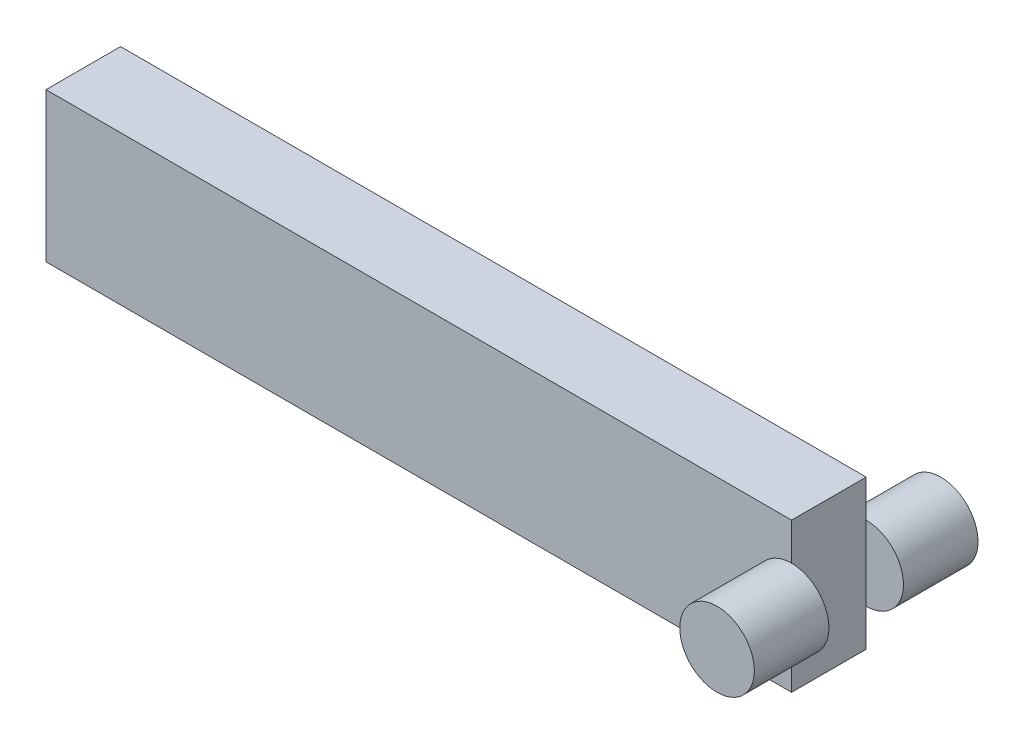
ISO-10303-21;
HEADER;
FILE_DESCRIPTION(('STEP AP214'),'2;1');
FILE_NAME('part.step','',(''),(''),'','','');
FILE_SCHEMA(('AUTOMOTIVE_DESIGN { 1 0 10303 214 1 1 1 1 }'));
ENDSEC;
DATA;
#1=APPLICATION_CONTEXT('core data for automotive mechanical design processes');
#2=APPLICATION_PROTOCOL_DEFINITION('international standard','automotive_design',2000,#1);
#3=PRODUCT_CONTEXT('',#1,'mechanical');
#4=PRODUCT('Part','Part','',(#3));
#5=PRODUCT_RELATED_PRODUCT_CATEGORY('part','',(#4));
#6=PRODUCT_DEFINITION_FORMATION('','',#4);
#7=PRODUCT_DEFINITION_CONTEXT('part definition',#1,'design');
#8=PRODUCT_DEFINITION('design','',#6,#7);
#9=PRODUCT_DEFINITION_SHAPE('','',#8);
#10=(LENGTH_UNIT() NAMED_UNIT(*) SI_UNIT(.MILLI.,.METRE.));
#11=(NAMED_UNIT(*) PLANE_ANGLE_UNIT() SI_UNIT($,.RADIAN.));
#12=(NAMED_UNIT(*) SI_UNIT($,.STERADIAN.) SOLID_ANGLE_UNIT());
#13=UNCERTAINTY_MEASURE_WITH_UNIT(LENGTH_MEASURE(1.E-05),#10,'distance_accuracy_value','');
#14=(GEOMETRIC_REPRESENTATION_CONTEXT(3) GLOBAL_UNCERTAINTY_ASSIGNED_CONTEXT((#13)) GLOBAL_UNIT_ASSIGNED_CONTEXT((#10,
#11,#12)) REPRESENTATION_CONTEXT('',''));
#15=CARTESIAN_POINT('',(0.,0.,0.));
#16=DIRECTION('',(0.,0.,1.));
#17=DIRECTION('',(1.,0.,0.));
#18=AXIS2_PLACEMENT_3D('',#15,#16,#17);
#19=CARTESIAN_POINT('',(0.,0.,-10.));
#20=DIRECTION('',(0.,0.,1.));
#21=DIRECTION('',(1.,0.,0.));
#22=AXIS2_PLACEMENT_3D('',#19,#20,#21);
#23=PLANE('',#22);
#24=CARTESIAN_POINT('',(100.,0.,-10.));
#25=DIRECTION('',(0.,0.,-1.));
#26=DIRECTION('',(-1.,0.,0.));
#27=AXIS2_PLACEMENT_3D('',#24,#25,#26);
#28=CIRCLE('',#27,9.99999999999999);
#29=CARTESIAN_POINT('',(100.,-9.99999999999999,-10.));
#30=VERTEX_POINT('',#29);
#31=CARTESIAN_POINT('',(100.,9.99999999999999,-10.));
#32=VERTEX_POINT('',#31);
#33=EDGE_CURVE('E11',#30,#32,#28,.T.);
#34=ORIENTED_EDGE('',*,*,#33,.F.);
#35=DIRECTION('',(0.,1.,0.));
#36=VECTOR('',#35,1.);
#37=CARTESIAN_POINT('',(100.,20.,-10.));
#38=LINE('',#37,#36);
#39=CARTESIAN_POINT('',(100.,-20.,-10.));
#40=VERTEX_POINT('',#39);
#41=EDGE_CURVE('E123',#40,#30,#38,.T.);
#42=ORIENTED_EDGE('',*,*,#41,.F.);
#43=DIRECTION('',(1.,0.,0.));
#44=VECTOR('',#43,1.);
#45=CARTESIAN_POINT('',(-100.,-20.,-10.));
#46=LINE('',#45,#44);
#47=CARTESIAN_POINT('',(-100.,-20.,-10.));
#48=VERTEX_POINT('',#47);
#49=EDGE_CURVE('E132',#48,#40,#46,.T.);
#50=ORIENTED_EDGE('',*,*,#49,.F.);
#51=DIRECTION('',(0.,-1.,0.));
#52=VECTOR('',#51,1.);
#53=CARTESIAN_POINT('',(-100.,20.,-10.));
#54=LINE('',#53,#52);
#55=CARTESIAN_POINT('',(-100.,20.,-10.));
#56=VERTEX_POINT('',#55);
#57=EDGE_CURVE('E129',#56,#48,#54,.T.);
#58=ORIENTED_EDGE('',*,*,#57,.F.);
#59=DIRECTION('',(-1.,0.,0.));
#60=VECTOR('',#59,1.);
#61=CARTESIAN_POINT('',(-100.,20.,-10.));
#62=LINE('',#61,#60);
#63=CARTESIAN_POINT('',(100.,20.,-10.));
#64=VERTEX_POINT('',#63);
#65=EDGE_CURVE('E125',#64,#56,#62,.T.);
#66=ORIENTED_EDGE('',*,*,#65,.F.);
#67=EDGE_CURVE('E122',#32,#64,#38,.T.);
#68=ORIENTED_EDGE('',*,*,#67,.F.);
#69=EDGE_LOOP('',(#34,#42,#50,#58,#66,#68));
#70=FACE_BOUND('',#69,.T.);
#71=ADVANCED_FACE('F33',(#70),#23,.F.);
#72=CARTESIAN_POINT('',(100.,20.,-10.));
#73=DIRECTION('',(1.,0.,0.));
#74=DIRECTION('',(0.,0.,-1.));
#75=AXIS2_PLACEMENT_3D('',#72,#73,#74);
#76=PLANE('',#75);
#77=DIRECTION('',(0.,0.,1.));
#78=VECTOR('',#77,1.);
#79=CARTESIAN_POINT('',(100.,20.,-10.));
#80=LINE('',#79,#78);
#81=CARTESIAN_POINT('',(100.,20.,10.));
#82=VERTEX_POINT('',#81);
#83=EDGE_CURVE('E37',#64,#82,#80,.T.);
#84=ORIENTED_EDGE('',*,*,#83,.T.);
#85=DIRECTION('',(0.,1.,0.));
#86=VECTOR('',#85,1.);
#87=CARTESIAN_POINT('',(100.,20.,10.));
#88=LINE('',#87,#86);
#89=CARTESIAN_POINT('',(100.,9.99999999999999,10.));
#90=VERTEX_POINT('',#89);
#91=EDGE_CURVE('E98',#90,#82,#88,.T.);
#92=ORIENTED_EDGE('',*,*,#91,.F.);
#93=CARTESIAN_POINT('',(100.,-9.99999999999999,10.));
#94=VERTEX_POINT('',#93);
#95=EDGE_CURVE('E96',#94,#90,#88,.T.);
#96=ORIENTED_EDGE('',*,*,#95,.F.);
#97=CARTESIAN_POINT('',(100.,-20.,10.));
#98=VERTEX_POINT('',#97);
#99=EDGE_CURVE('E88',#98,#94,#88,.T.);
#100=ORIENTED_EDGE('',*,*,#99,.F.);
#101=DIRECTION('',(0.,0.,1.));
#102=VECTOR('',#101,1.);
#103=CARTESIAN_POINT('',(100.,-20.,-10.));
#104=LINE('',#103,#102);
#105=EDGE_CURVE('E42',#40,#98,#104,.T.);
#106=ORIENTED_EDGE('',*,*,#105,.F.);
#107=ORIENTED_EDGE('',*,*,#41,.T.);
#108=EDGE_CURVE('E126',#30,#32,#38,.T.);
#109=ORIENTED_EDGE('',*,*,#108,.T.);
#110=ORIENTED_EDGE('',*,*,#67,.T.);
#111=EDGE_LOOP('',(#84,#92,#96,#100,#106,#107,#109,#110));
#112=FACE_BOUND('',#111,.T.);
#113=ADVANCED_FACE('F35',(#112),#76,.T.);
#114=CARTESIAN_POINT('',(-100.,-20.,-10.));
#115=DIRECTION('',(0.,-1.,0.));
#116=DIRECTION('',(0.,0.,-1.));
#117=AXIS2_PLACEMENT_3D('',#114,#115,#116);
#118=PLANE('',#117);
#119=ORIENTED_EDGE('',*,*,#105,.T.);
#120=DIRECTION('',(1.,0.,0.));
#121=VECTOR('',#120,1.);
#122=CARTESIAN_POINT('',(-100.,-20.,10.));
#123=LINE('',#122,#121);
#124=CARTESIAN_POINT('',(-100.,-20.,10.));
#125=VERTEX_POINT('',#124);
#126=EDGE_CURVE('E93',#125,#98,#123,.T.);
#127=ORIENTED_EDGE('',*,*,#126,.F.);
#128=DIRECTION('',(0.,0.,1.));
#129=VECTOR('',#128,1.);
#130=CARTESIAN_POINT('',(-100.,-20.,-10.));
#131=LINE('',#130,#129);
#132=EDGE_CURVE('E136',#48,#125,#131,.T.);
#133=ORIENTED_EDGE('',*,*,#132,.F.);
#134=ORIENTED_EDGE('',*,*,#49,.T.);
#135=EDGE_LOOP('',(#119,#127,#133,#134));
#136=FACE_BOUND('',#135,.T.);
#137=ADVANCED_FACE('F149',(#136),#118,.T.);
#138=CARTESIAN_POINT('',(-100.,20.,-10.));
#139=DIRECTION('',(-1.,0.,0.));
#140=DIRECTION('',(0.,0.,1.));
#141=AXIS2_PLACEMENT_3D('',#138,#139,#140);
#142=PLANE('',#141);
#143=ORIENTED_EDGE('',*,*,#132,.T.);
#144=DIRECTION('',(0.,-1.,0.));
#145=VECTOR('',#144,1.);
#146=CARTESIAN_POINT('',(-100.,20.,10.));
#147=LINE('',#146,#145);
#148=CARTESIAN_POINT('',(-100.,20.,10.));
#149=VERTEX_POINT('',#148);
#150=EDGE_CURVE('E119',#149,#125,#147,.T.);
#151=ORIENTED_EDGE('',*,*,#150,.F.);
#152=DIRECTION('',(0.,0.,1.));
#153=VECTOR('',#152,1.);
#154=CARTESIAN_POINT('',(-100.,20.,-10.));
#155=LINE('',#154,#153);
#156=EDGE_CURVE('E137',#56,#149,#155,.T.);
#157=ORIENTED_EDGE('',*,*,#156,.F.);
#158=ORIENTED_EDGE('',*,*,#57,.T.);
#159=EDGE_LOOP('',(#143,#151,#157,#158));
#160=FACE_BOUND('',#159,.T.);
#161=ADVANCED_FACE('F145',(#160),#142,.T.);
#162=CARTESIAN_POINT('',(-100.,20.,-10.));
#163=DIRECTION('',(0.,1.,0.));
#164=DIRECTION('',(0.,0.,1.));
#165=AXIS2_PLACEMENT_3D('',#162,#163,#164);
#166=PLANE('',#165);
#167=ORIENTED_EDGE('',*,*,#156,.T.);
#168=DIRECTION('',(-1.,0.,0.));
#169=VECTOR('',#168,1.);
#170=CARTESIAN_POINT('',(-100.,20.,10.));
#171=LINE('',#170,#169);
#172=EDGE_CURVE('E95',#82,#149,#171,.T.);
#173=ORIENTED_EDGE('',*,*,#172,.F.);
#174=ORIENTED_EDGE('',*,*,#83,.F.);
#175=ORIENTED_EDGE('',*,*,#65,.T.);
#176=EDGE_LOOP('',(#167,#173,#174,#175));
#177=FACE_BOUND('',#176,.T.);
#178=ADVANCED_FACE('F142',(#177),#166,.T.);
#179=CARTESIAN_POINT('',(0.,0.,10.));
#180=DIRECTION('',(0.,0.,1.));
#181=DIRECTION('',(1.,0.,0.));
#182=AXIS2_PLACEMENT_3D('',#179,#180,#181);
#183=PLANE('',#182);
#184=CARTESIAN_POINT('',(100.,0.,10.));
#185=DIRECTION('',(0.,0.,1.));
#186=DIRECTION('',(1.,0.,0.));
#187=AXIS2_PLACEMENT_3D('',#184,#185,#186);
#188=CIRCLE('',#187,9.99999999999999);
#189=EDGE_CURVE('E51',#90,#94,#188,.T.);
#190=ORIENTED_EDGE('',*,*,#189,.F.);
#191=ORIENTED_EDGE('',*,*,#91,.T.);
#192=ORIENTED_EDGE('',*,*,#172,.T.);
#193=ORIENTED_EDGE('',*,*,#150,.T.);
#194=ORIENTED_EDGE('',*,*,#126,.T.);
#195=ORIENTED_EDGE('',*,*,#99,.T.);
#196=EDGE_LOOP('',(#190,#191,#192,#193,#194,#195));
#197=FACE_BOUND('',#196,.T.);
#198=ADVANCED_FACE('F90',(#197),#183,.T.);
#199=CARTESIAN_POINT('',(100.,0.,-30.));
#200=DIRECTION('',(0.,0.,1.));
#201=DIRECTION('',(1.,0.,0.));
#202=AXIS2_PLACEMENT_3D('',#199,#200,#201);
#203=CYLINDRICAL_SURFACE('',#202,9.99999999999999);
#204=CARTESIAN_POINT('',(100.,0.,-30.));
#205=DIRECTION('',(0.,0.,-1.));
#206=DIRECTION('',(-1.,0.,0.));
#207=AXIS2_PLACEMENT_3D('',#204,#205,#206);
#208=CIRCLE('',#207,9.99999999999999);
#209=CARTESIAN_POINT('',(90.,0.,-30.));
#210=VERTEX_POINT('',#209);
#211=EDGE_CURVE('E113',#210,#210,#208,.T.);
#212=ORIENTED_EDGE('',*,*,#211,.F.);
#213=EDGE_LOOP('',(#212));
#214=FACE_BOUND('',#213,.T.);
#215=EDGE_CURVE('E44',#32,#30,#28,.T.);
#216=ORIENTED_EDGE('',*,*,#215,.T.);
#217=ORIENTED_EDGE('',*,*,#33,.T.);
#218=EDGE_LOOP('',(#216,#217));
#219=FACE_BOUND('',#218,.T.);
#220=ADVANCED_FACE('F153',(#214,#219),#203,.T.);
#221=CARTESIAN_POINT('',(100.,0.,-30.));
#222=DIRECTION('',(0.,0.,-1.));
#223=DIRECTION('',(-1.,0.,0.));
#224=AXIS2_PLACEMENT_3D('',#221,#222,#223);
#225=PLANE('',#224);
#226=ORIENTED_EDGE('',*,*,#211,.T.);
#227=EDGE_LOOP('',(#226));
#228=FACE_BOUND('',#227,.T.);
#229=ADVANCED_FACE('F157',(#228),#225,.T.);
#230=CARTESIAN_POINT('',(100.,0.,-10.));
#231=DIRECTION('',(0.,0.,-1.));
#232=DIRECTION('',(-1.,0.,0.));
#233=AXIS2_PLACEMENT_3D('',#230,#231,#232);
#234=PLANE('',#233);
#235=ORIENTED_EDGE('',*,*,#108,.F.);
#236=ORIENTED_EDGE('',*,*,#215,.F.);
#237=EDGE_LOOP('',(#235,#236));
#238=FACE_BOUND('',#237,.T.);
#239=ADVANCED_FACE('F155',(#238),#234,.F.);
#240=CARTESIAN_POINT('',(100.,0.,10.));
#241=DIRECTION('',(0.,0.,1.));
#242=DIRECTION('',(1.,0.,0.));
#243=AXIS2_PLACEMENT_3D('',#240,#241,#242);
#244=PLANE('',#243);
#245=EDGE_CURVE('E104',#94,#90,#188,.T.);
#246=ORIENTED_EDGE('',*,*,#245,.F.);
#247=ORIENTED_EDGE('',*,*,#95,.T.);
#248=EDGE_LOOP('',(#246,#247));
#249=FACE_BOUND('',#248,.T.);
#250=ADVANCED_FACE('F105',(#249),#244,.F.);
#251=CARTESIAN_POINT('',(100.,0.,30.));
#252=DIRECTION('',(0.,0.,-1.));
#253=DIRECTION('',(-1.,0.,0.));
#254=AXIS2_PLACEMENT_3D('',#251,#252,#253);
#255=CYLINDRICAL_SURFACE('',#254,9.99999999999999);
#256=CARTESIAN_POINT('',(100.,0.,30.));
#257=DIRECTION('',(0.,0.,1.));
#258=DIRECTION('',(1.,0.,0.));
#259=AXIS2_PLACEMENT_3D('',#256,#257,#258);
#260=CIRCLE('',#259,9.99999999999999);
#261=CARTESIAN_POINT('',(110.,0.,30.));
#262=VERTEX_POINT('',#261);
#263=EDGE_CURVE('E109',#262,#262,#260,.T.);
#264=ORIENTED_EDGE('',*,*,#263,.F.);
#265=EDGE_LOOP('',(#264));
#266=FACE_BOUND('',#265,.T.);
#267=ORIENTED_EDGE('',*,*,#189,.T.);
#268=ORIENTED_EDGE('',*,*,#245,.T.);
#269=EDGE_LOOP('',(#267,#268));
#270=FACE_BOUND('',#269,.T.);
#271=ADVANCED_FACE('F108',(#266,#270),#255,.T.);
#272=CARTESIAN_POINT('',(100.,0.,30.));
#273=DIRECTION('',(0.,0.,1.));
#274=DIRECTION('',(1.,0.,0.));
#275=AXIS2_PLACEMENT_3D('',#272,#273,#274);
#276=PLANE('',#275);
#277=ORIENTED_EDGE('',*,*,#263,.T.);
#278=EDGE_LOOP('',(#277));
#279=FACE_BOUND('',#278,.T.);
#280=ADVANCED_FACE('F224',(#279),#276,.T.);
#281=CLOSED_SHELL('',(#71,#113,#137,#161,#178,#198,#220,#229,#239,#250,#271,#280));
#282=MANIFOLD_SOLID_BREP('B2',#281);
#283=ADVANCED_BREP_SHAPE_REPRESENTATION('',(#18,#282),#14);
#284=SHAPE_DEFINITION_REPRESENTATION(#9,#283);
ENDSEC;
END-ISO-10303-21;
